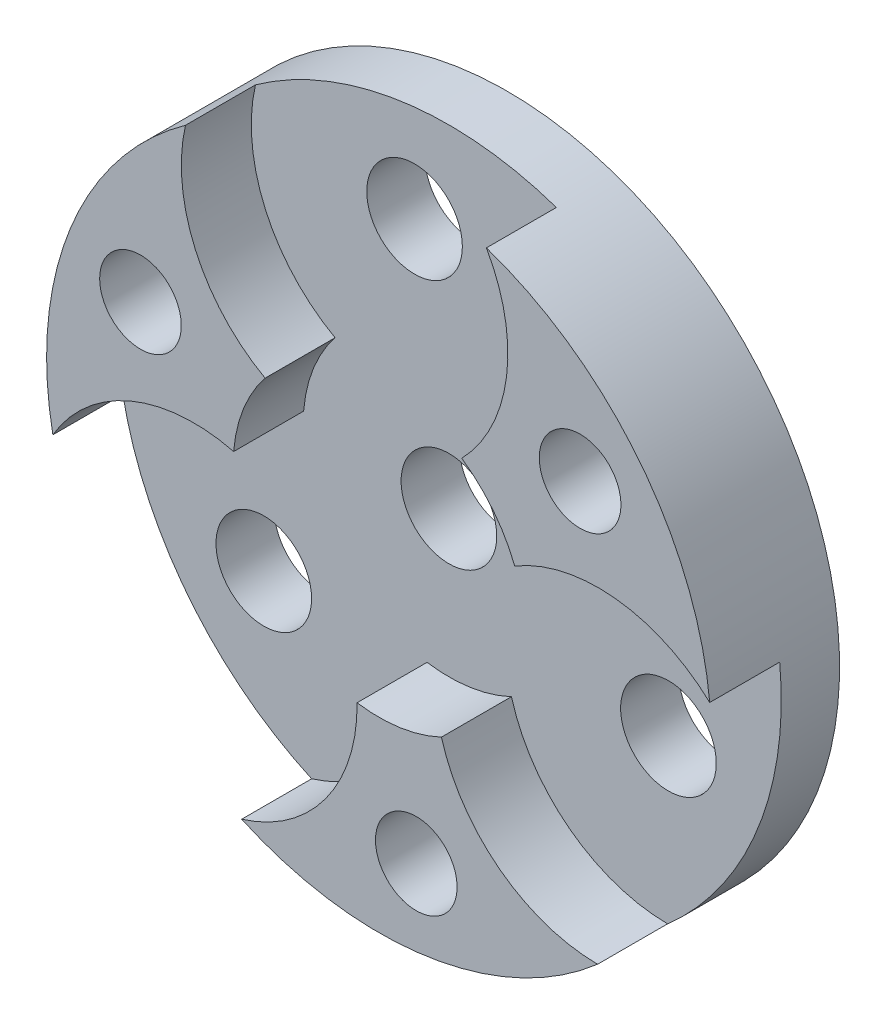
ISO-10303-21;
HEADER;
FILE_DESCRIPTION(('STEP AP214'),'2;1');
FILE_NAME('part.step','',(''),(''),'','','');
FILE_SCHEMA(('AUTOMOTIVE_DESIGN { 1 0 10303 214 1 1 1 1 }'));
ENDSEC;
DATA;
#1=APPLICATION_CONTEXT('core data for automotive mechanical design processes');
#2=APPLICATION_PROTOCOL_DEFINITION('international standard','automotive_design',2000,#1);
#3=PRODUCT_CONTEXT('',#1,'mechanical');
#4=PRODUCT('Part','Part','',(#3));
#5=PRODUCT_RELATED_PRODUCT_CATEGORY('part','',(#4));
#6=PRODUCT_DEFINITION_FORMATION('','',#4);
#7=PRODUCT_DEFINITION_CONTEXT('part definition',#1,'design');
#8=PRODUCT_DEFINITION('design','',#6,#7);
#9=PRODUCT_DEFINITION_SHAPE('','',#8);
#10=(LENGTH_UNIT() NAMED_UNIT(*) SI_UNIT(.MILLI.,.METRE.));
#11=(NAMED_UNIT(*) PLANE_ANGLE_UNIT() SI_UNIT($,.RADIAN.));
#12=(NAMED_UNIT(*) SI_UNIT($,.STERADIAN.) SOLID_ANGLE_UNIT());
#13=UNCERTAINTY_MEASURE_WITH_UNIT(LENGTH_MEASURE(1.E-05),#10,'distance_accuracy_value','');
#14=(GEOMETRIC_REPRESENTATION_CONTEXT(3) GLOBAL_UNCERTAINTY_ASSIGNED_CONTEXT((#13)) GLOBAL_UNIT_ASSIGNED_CONTEXT((#10,
#11,#12)) REPRESENTATION_CONTEXT('',''));
#15=CARTESIAN_POINT('',(0.,0.,0.));
#16=DIRECTION('',(0.,0.,1.));
#17=DIRECTION('',(1.,0.,0.));
#18=AXIS2_PLACEMENT_3D('',#15,#16,#17);
#19=CARTESIAN_POINT('',(-0.793834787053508,-0.628476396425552,3.65));
#20=DIRECTION('',(0.,0.,1.));
#21=DIRECTION('',(1.,0.,0.));
#22=AXIS2_PLACEMENT_3D('',#19,#20,#21);
#23=PLANE('',#22);
#24=CARTESIAN_POINT('',(-1.587669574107,-1.256952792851,3.65));
#25=DIRECTION('',(0.,0.,-1.));
#26=DIRECTION('',(1.,0.,0.));
#27=AXIS2_PLACEMENT_3D('',#24,#25,#26);
#28=CIRCLE('',#27,1.40000000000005);
#29=CARTESIAN_POINT('',(-0.187829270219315,-1.23580749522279,3.65));
#30=VERTEX_POINT('',#29);
#31=CARTESIAN_POINT('',(-1.17731552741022,-2.59546299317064,3.65));
#32=VERTEX_POINT('',#31);
#33=EDGE_CURVE('E134',#30,#32,#28,.T.);
#34=ORIENTED_EDGE('',*,*,#33,.T.);
#35=CARTESIAN_POINT('',(0.,-1.03649727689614E-13,3.65));
#36=DIRECTION('',(0.,0.,1.));
#37=DIRECTION('',(-1.,0.,0.));
#38=AXIS2_PLACEMENT_3D('',#35,#36,#37);
#39=CIRCLE('',#38,2.84999999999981);
#40=CARTESIAN_POINT('',(1.87488269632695,-2.14646567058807,3.65));
#41=VERTEX_POINT('',#40);
#42=EDGE_CURVE('E122',#32,#41,#39,.T.);
#43=ORIENTED_EDGE('',*,*,#42,.T.);
#44=CARTESIAN_POINT('',(1.88238783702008,-0.746485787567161,3.65));
#45=DIRECTION('',(0.,0.,-1.));
#46=DIRECTION('',(1.,0.,0.));
#47=AXIS2_PLACEMENT_3D('',#44,#45,#46);
#48=CIRCLE('',#47,1.40000000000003);
#49=CARTESIAN_POINT('',(0.535760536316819,-1.12936293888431,3.65));
#50=VERTEX_POINT('',#49);
#51=EDGE_CURVE('E133',#41,#50,#48,.T.);
#52=ORIENTED_EDGE('',*,*,#51,.T.);
#53=CARTESIAN_POINT('',(0.,-1.03649727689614E-13,3.65));
#54=DIRECTION('',(0.,0.,-1.));
#55=DIRECTION('',(1.,0.,0.));
#56=AXIS2_PLACEMENT_3D('',#53,#54,#55);
#57=CIRCLE('',#56,1.24999999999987);
#58=EDGE_CURVE('E139',#50,#30,#57,.T.);
#59=ORIENTED_EDGE('',*,*,#58,.T.);
#60=EDGE_LOOP('',(#34,#43,#52,#59));
#61=FACE_BOUND('',#60,.T.);
#62=CARTESIAN_POINT('',(0.320187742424,-2.176575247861,3.65));
#63=DIRECTION('',(0.,0.,-1.));
#64=DIRECTION('',(-1.,0.,0.));
#65=AXIS2_PLACEMENT_3D('',#62,#63,#64);
#66=CIRCLE('',#65,0.35);
#67=CARTESIAN_POINT('',(-0.0298122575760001,-2.176575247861,3.65));
#68=VERTEX_POINT('',#67);
#69=EDGE_CURVE('E345',#68,#68,#66,.T.);
#70=ORIENTED_EDGE('',*,*,#69,.T.);
#71=EDGE_LOOP('',(#70));
#72=FACE_BOUND('',#71,.T.);
#73=ADVANCED_FACE('F34',(#61,#72),#23,.T.);
#74=CARTESIAN_POINT('',(-0.147359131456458,1.0017192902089,3.05));
#75=DIRECTION('',(0.,0.,1.));
#76=DIRECTION('',(1.,0.,0.));
#77=AXIS2_PLACEMENT_3D('',#74,#75,#76);
#78=PLANE('',#77);
#79=CARTESIAN_POINT('',(-0.294718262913,2.003438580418,3.05));
#80=DIRECTION('',(0.,0.,1.));
#81=DIRECTION('',(1.,0.,0.));
#82=AXIS2_PLACEMENT_3D('',#79,#80,#81);
#83=CIRCLE('',#82,0.410000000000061);
#84=CARTESIAN_POINT('',(0.115281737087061,2.003438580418,3.05));
#85=VERTEX_POINT('',#84);
#86=EDGE_CURVE('E342',#85,#85,#83,.T.);
#87=ORIENTED_EDGE('',*,*,#86,.F.);
#88=EDGE_LOOP('',(#87));
#89=FACE_BOUND('',#88,.T.);
#90=CARTESIAN_POINT('',(-1.587669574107,-1.256952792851,3.05));
#91=DIRECTION('',(0.,0.,1.));
#92=DIRECTION('',(1.,0.,0.));
#93=AXIS2_PLACEMENT_3D('',#90,#91,#92);
#94=CIRCLE('',#93,0.410000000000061);
#95=CARTESIAN_POINT('',(-1.17766957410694,-1.256952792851,3.05));
#96=VERTEX_POINT('',#95);
#97=EDGE_CURVE('E338',#96,#96,#94,.T.);
#98=ORIENTED_EDGE('',*,*,#97,.F.);
#99=EDGE_LOOP('',(#98));
#100=FACE_BOUND('',#99,.T.);
#101=CARTESIAN_POINT('',(1.88238783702,-0.7464857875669,3.05));
#102=DIRECTION('',(0.,0.,1.));
#103=DIRECTION('',(1.,0.,0.));
#104=AXIS2_PLACEMENT_3D('',#101,#102,#103);
#105=CIRCLE('',#104,0.410000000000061);
#106=CARTESIAN_POINT('',(2.29238783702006,-0.7464857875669,3.05));
#107=VERTEX_POINT('',#106);
#108=EDGE_CURVE('E334',#107,#107,#105,.T.);
#109=ORIENTED_EDGE('',*,*,#108,.F.);
#110=EDGE_LOOP('',(#109));
#111=FACE_BOUND('',#110,.T.);
#112=CARTESIAN_POINT('',(0.,0.,3.05));
#113=DIRECTION('',(0.,0.,1.));
#114=DIRECTION('',(1.,0.,0.));
#115=AXIS2_PLACEMENT_3D('',#112,#113,#114);
#116=CIRCLE('',#115,0.410000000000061);
#117=CARTESIAN_POINT('',(0.410000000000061,0.,3.05));
#118=VERTEX_POINT('',#117);
#119=EDGE_CURVE('E297',#118,#118,#116,.T.);
#120=ORIENTED_EDGE('',*,*,#119,.F.);
#121=EDGE_LOOP('',(#120));
#122=FACE_BOUND('',#121,.T.);
#123=CARTESIAN_POINT('',(0.,0.,3.05));
#124=DIRECTION('',(0.,0.,1.));
#125=DIRECTION('',(1.,0.,0.));
#126=AXIS2_PLACEMENT_3D('',#123,#124,#125);
#127=CIRCLE('',#126,2.84999999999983);
#128=CARTESIAN_POINT('',(-2.79633514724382,-0.550463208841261,3.05));
#129=VERTEX_POINT('',#128);
#130=CARTESIAN_POINT('',(-1.17731552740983,-2.5954629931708,3.05));
#131=VERTEX_POINT('',#130);
#132=EDGE_CURVE('E178',#129,#131,#127,.T.);
#133=ORIENTED_EDGE('',*,*,#132,.T.);
#134=CARTESIAN_POINT('',(-1.587669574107,-1.256952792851,3.05));
#135=DIRECTION('',(0.,0.,-1.));
#136=DIRECTION('',(1.,0.,0.));
#137=AXIS2_PLACEMENT_3D('',#134,#135,#136);
#138=CIRCLE('',#137,1.40000000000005);
#139=CARTESIAN_POINT('',(-0.187829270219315,-1.23580749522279,3.05));
#140=VERTEX_POINT('',#139);
#141=EDGE_CURVE('E54',#140,#131,#138,.T.);
#142=ORIENTED_EDGE('',*,*,#141,.F.);
#143=CARTESIAN_POINT('',(0.,-1.03649727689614E-13,3.05));
#144=DIRECTION('',(0.,0.,-1.));
#145=DIRECTION('',(1.,0.,0.));
#146=AXIS2_PLACEMENT_3D('',#143,#144,#145);
#147=CIRCLE('',#146,1.24999999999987);
#148=CARTESIAN_POINT('',(0.535760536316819,-1.12936293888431,3.05));
#149=VERTEX_POINT('',#148);
#150=EDGE_CURVE('E49',#149,#140,#147,.T.);
#151=ORIENTED_EDGE('',*,*,#150,.F.);
#152=CARTESIAN_POINT('',(1.88238783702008,-0.746485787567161,3.05));
#153=DIRECTION('',(0.,0.,-1.));
#154=DIRECTION('',(1.,0.,0.));
#155=AXIS2_PLACEMENT_3D('',#152,#153,#154);
#156=CIRCLE('',#155,1.40000000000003);
#157=CARTESIAN_POINT('',(1.87488269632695,-2.14646567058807,3.05));
#158=VERTEX_POINT('',#157);
#159=EDGE_CURVE('E299',#158,#149,#156,.T.);
#160=ORIENTED_EDGE('',*,*,#159,.F.);
#161=CARTESIAN_POINT('',(2.83639465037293,0.278146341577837,3.05));
#162=VERTEX_POINT('',#161);
#163=EDGE_CURVE('E181',#158,#162,#127,.T.);
#164=ORIENTED_EDGE('',*,*,#163,.T.);
#165=CARTESIAN_POINT('',(1.88238783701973,-0.746485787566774,3.05));
#166=DIRECTION('',(0.,0.,-1.));
#167=DIRECTION('',(1.,0.,0.));
#168=AXIS2_PLACEMENT_3D('',#165,#166,#167);
#169=CIRCLE('',#168,1.39999999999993);
#170=CARTESIAN_POINT('',(1.16415532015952,0.455238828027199,3.05));
#171=VERTEX_POINT('',#170);
#172=EDGE_CURVE('E145',#171,#162,#169,.T.);
#173=ORIENTED_EDGE('',*,*,#172,.F.);
#174=CARTESIAN_POINT('',(-1.7206288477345E-13,0.,3.05));
#175=DIRECTION('',(0.,0.,-1.));
#176=DIRECTION('',(1.,0.,0.));
#177=AXIS2_PLACEMENT_3D('',#174,#175,#176);
#178=CIRCLE('',#177,1.24999999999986);
#179=CARTESIAN_POINT('',(0.710176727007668,1.02866370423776,3.05));
#180=VERTEX_POINT('',#179);
#181=EDGE_CURVE('E158',#180,#171,#178,.T.);
#182=ORIENTED_EDGE('',*,*,#181,.F.);
#183=CARTESIAN_POINT('',(-0.294718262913,2.003438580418,3.05));
#184=DIRECTION('',(0.,0.,-1.));
#185=DIRECTION('',(1.,0.,0.));
#186=AXIS2_PLACEMENT_3D('',#183,#184,#185);
#187=CIRCLE('',#186,1.39999999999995);
#188=CARTESIAN_POINT('',(0.921452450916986,2.69692887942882,3.05));
#189=VERTEX_POINT('',#188);
#190=EDGE_CURVE('E148',#189,#180,#187,.T.);
#191=ORIENTED_EDGE('',*,*,#190,.F.);
#192=CARTESIAN_POINT('',(-1.65907912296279,2.31731665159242,3.05));
#193=VERTEX_POINT('',#192);
#194=EDGE_CURVE('E182',#189,#193,#127,.T.);
#195=ORIENTED_EDGE('',*,*,#194,.T.);
#196=CARTESIAN_POINT('',(-0.294718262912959,2.0034385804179,3.05));
#197=DIRECTION('',(0.,0.,1.));
#198=DIRECTION('',(1.,0.,0.));
#199=AXIS2_PLACEMENT_3D('',#196,#197,#198);
#200=CIRCLE('',#199,1.40000000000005);
#201=CARTESIAN_POINT('',(-0.976326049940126,0.780568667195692,3.05));
#202=VERTEX_POINT('',#201);
#203=EDGE_CURVE('E180',#193,#202,#200,.T.);
#204=ORIENTED_EDGE('',*,*,#203,.T.);
#205=CARTESIAN_POINT('',(0.,0.,3.05));
#206=DIRECTION('',(0.,0.,1.));
#207=DIRECTION('',(1.,0.,0.));
#208=AXIS2_PLACEMENT_3D('',#205,#206,#207);
#209=CIRCLE('',#208,1.24999999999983);
#210=CARTESIAN_POINT('',(-1.24593726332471,0.100699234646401,3.05));
#211=VERTEX_POINT('',#210);
#212=EDGE_CURVE('E185',#202,#211,#209,.T.);
#213=ORIENTED_EDGE('',*,*,#212,.T.);
#214=CARTESIAN_POINT('',(-1.587669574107,-1.256952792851,3.05));
#215=DIRECTION('',(0.,0.,1.));
#216=DIRECTION('',(1.,0.,0.));
#217=AXIS2_PLACEMENT_3D('',#214,#215,#216);
#218=CIRCLE('',#217,1.40000000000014);
#219=EDGE_CURVE('E188',#211,#129,#218,.T.);
#220=ORIENTED_EDGE('',*,*,#219,.T.);
#221=EDGE_LOOP('',(#133,#142,#151,#160,#164,#173,#182,#191,#195,#204,#213,#220));
#222=FACE_BOUND('',#221,.T.);
#223=ADVANCED_FACE('F211',(#89,#100,#111,#122,#222),#78,.T.);
#224=CARTESIAN_POINT('',(0.,0.,3.65));
#225=DIRECTION('',(0.,0.,-1.));
#226=DIRECTION('',(-1.,0.,0.));
#227=AXIS2_PLACEMENT_3D('',#224,#225,#226);
#228=CYLINDRICAL_SURFACE('',#227,2.84999999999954);
#229=DIRECTION('',(0.,0.,1.));
#230=VECTOR('',#229,1.);
#231=CARTESIAN_POINT('',(-2.79633514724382,-0.550463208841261,3.05));
#232=LINE('',#231,#230);
#233=CARTESIAN_POINT('',(-2.79633514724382,-0.550463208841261,3.65));
#234=VERTEX_POINT('',#233);
#235=EDGE_CURVE('E199',#129,#234,#232,.T.);
#236=ORIENTED_EDGE('',*,*,#235,.T.);
#237=CARTESIAN_POINT('',(0.,0.,3.65));
#238=DIRECTION('',(0.,0.,-1.));
#239=DIRECTION('',(-1.,0.,0.));
#240=AXIS2_PLACEMENT_3D('',#237,#238,#239);
#241=CIRCLE('',#240,2.84999999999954);
#242=CARTESIAN_POINT('',(-1.65907912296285,2.31731665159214,3.65));
#243=VERTEX_POINT('',#242);
#244=EDGE_CURVE('E11',#234,#243,#241,.T.);
#245=ORIENTED_EDGE('',*,*,#244,.T.);
#246=DIRECTION('',(0.,0.,1.));
#247=VECTOR('',#246,1.);
#248=CARTESIAN_POINT('',(-1.65907912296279,2.31731665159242,3.05));
#249=LINE('',#248,#247);
#250=EDGE_CURVE('E191',#193,#243,#249,.T.);
#251=ORIENTED_EDGE('',*,*,#250,.F.);
#252=ORIENTED_EDGE('',*,*,#194,.F.);
#253=DIRECTION('',(0.,0.,-1.));
#254=VECTOR('',#253,1.);
#255=CARTESIAN_POINT('',(0.921452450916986,2.69692887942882,3.65));
#256=LINE('',#255,#254);
#257=CARTESIAN_POINT('',(0.921452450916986,2.69692887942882,3.65));
#258=VERTEX_POINT('',#257);
#259=EDGE_CURVE('E172',#258,#189,#256,.T.);
#260=ORIENTED_EDGE('',*,*,#259,.F.);
#261=CARTESIAN_POINT('',(-1.7206288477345E-13,0.,3.65));
#262=DIRECTION('',(0.,0.,1.));
#263=DIRECTION('',(-1.,0.,0.));
#264=AXIS2_PLACEMENT_3D('',#261,#262,#263);
#265=CIRCLE('',#264,2.8499999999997);
#266=CARTESIAN_POINT('',(2.83639465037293,0.278146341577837,3.65));
#267=VERTEX_POINT('',#266);
#268=EDGE_CURVE('E157',#267,#258,#265,.T.);
#269=ORIENTED_EDGE('',*,*,#268,.F.);
#270=DIRECTION('',(0.,0.,-1.));
#271=VECTOR('',#270,1.);
#272=CARTESIAN_POINT('',(2.83639465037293,0.278146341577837,3.65));
#273=LINE('',#272,#271);
#274=EDGE_CURVE('E174',#267,#162,#273,.T.);
#275=ORIENTED_EDGE('',*,*,#274,.T.);
#276=ORIENTED_EDGE('',*,*,#163,.F.);
#277=DIRECTION('',(0.,0.,-1.));
#278=VECTOR('',#277,1.);
#279=CARTESIAN_POINT('',(1.87488269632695,-2.14646567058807,3.65));
#280=LINE('',#279,#278);
#281=EDGE_CURVE('E130',#41,#158,#280,.T.);
#282=ORIENTED_EDGE('',*,*,#281,.F.);
#283=ORIENTED_EDGE('',*,*,#42,.F.);
#284=DIRECTION('',(0.,0.,-1.));
#285=VECTOR('',#284,1.);
#286=CARTESIAN_POINT('',(-1.17731552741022,-2.59546299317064,3.65));
#287=LINE('',#286,#285);
#288=EDGE_CURVE('E128',#32,#131,#287,.T.);
#289=ORIENTED_EDGE('',*,*,#288,.T.);
#290=ORIENTED_EDGE('',*,*,#132,.F.);
#291=EDGE_LOOP('',(#236,#245,#251,#252,#260,#269,#275,#276,#282,#283,#289,#290));
#292=FACE_BOUND('',#291,.T.);
#293=CARTESIAN_POINT('',(0.,0.,2.55));
#294=DIRECTION('',(0.,0.,-1.));
#295=DIRECTION('',(-1.,0.,0.));
#296=AXIS2_PLACEMENT_3D('',#293,#294,#295);
#297=CIRCLE('',#296,2.84999999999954);
#298=CARTESIAN_POINT('',(-2.84999999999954,0.,2.55));
#299=VERTEX_POINT('',#298);
#300=EDGE_CURVE('E42',#299,#299,#297,.T.);
#301=ORIENTED_EDGE('',*,*,#300,.F.);
#302=EDGE_LOOP('',(#301));
#303=FACE_BOUND('',#302,.T.);
#304=ADVANCED_FACE('F36',(#292,#303),#228,.T.);
#305=CARTESIAN_POINT('',(2.84999999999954,0.,3.65));
#306=DIRECTION('',(0.,0.,1.));
#307=DIRECTION('',(1.,0.,0.));
#308=AXIS2_PLACEMENT_3D('',#305,#306,#307);
#309=PLANE('',#308);
#310=CARTESIAN_POINT('',(-2.045063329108,0.810996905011,3.65));
#311=DIRECTION('',(0.,0.,-1.));
#312=DIRECTION('',(-1.,0.,0.));
#313=AXIS2_PLACEMENT_3D('',#310,#311,#312);
#314=CIRCLE('',#313,0.35);
#315=CARTESIAN_POINT('',(-2.395063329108,0.810996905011,3.65));
#316=VERTEX_POINT('',#315);
#317=EDGE_CURVE('E349',#316,#316,#314,.T.);
#318=ORIENTED_EDGE('',*,*,#317,.T.);
#319=EDGE_LOOP('',(#318));
#320=FACE_BOUND('',#319,.T.);
#321=CARTESIAN_POINT('',(-1.587669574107,-1.256952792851,3.65));
#322=DIRECTION('',(0.,0.,1.));
#323=DIRECTION('',(1.,0.,0.));
#324=AXIS2_PLACEMENT_3D('',#321,#322,#323);
#325=CIRCLE('',#324,1.40000000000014);
#326=CARTESIAN_POINT('',(-1.24593726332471,0.100699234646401,3.65));
#327=VERTEX_POINT('',#326);
#328=EDGE_CURVE('E197',#327,#234,#325,.T.);
#329=ORIENTED_EDGE('',*,*,#328,.F.);
#330=CARTESIAN_POINT('',(0.,0.,3.65));
#331=DIRECTION('',(0.,0.,1.));
#332=DIRECTION('',(1.,0.,0.));
#333=AXIS2_PLACEMENT_3D('',#330,#331,#332);
#334=CIRCLE('',#333,1.24999999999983);
#335=CARTESIAN_POINT('',(-0.976326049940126,0.780568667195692,3.65));
#336=VERTEX_POINT('',#335);
#337=EDGE_CURVE('E194',#336,#327,#334,.T.);
#338=ORIENTED_EDGE('',*,*,#337,.F.);
#339=CARTESIAN_POINT('',(-0.294718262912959,2.0034385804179,3.65));
#340=DIRECTION('',(0.,0.,1.));
#341=DIRECTION('',(1.,0.,0.));
#342=AXIS2_PLACEMENT_3D('',#339,#340,#341);
#343=CIRCLE('',#342,1.40000000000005);
#344=EDGE_CURVE('E177',#243,#336,#343,.T.);
#345=ORIENTED_EDGE('',*,*,#344,.F.);
#346=ORIENTED_EDGE('',*,*,#244,.F.);
#347=EDGE_LOOP('',(#329,#338,#345,#346));
#348=FACE_BOUND('',#347,.T.);
#349=ADVANCED_FACE('F210',(#320,#348),#309,.T.);
#350=CARTESIAN_POINT('',(0.,0.,2.55));
#351=DIRECTION('',(0.,0.,-1.));
#352=DIRECTION('',(-1.,0.,0.));
#353=AXIS2_PLACEMENT_3D('',#350,#351,#352);
#354=PLANE('',#353);
#355=CARTESIAN_POINT('',(1.724875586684,1.36557834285,2.55));
#356=DIRECTION('',(0.,0.,-1.));
#357=DIRECTION('',(-1.,0.,0.));
#358=AXIS2_PLACEMENT_3D('',#355,#356,#357);
#359=CIRCLE('',#358,0.35);
#360=CARTESIAN_POINT('',(1.374875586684,1.36557834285,2.55));
#361=VERTEX_POINT('',#360);
#362=EDGE_CURVE('E272',#361,#361,#359,.T.);
#363=ORIENTED_EDGE('',*,*,#362,.F.);
#364=EDGE_LOOP('',(#363));
#365=FACE_BOUND('',#364,.T.);
#366=CARTESIAN_POINT('',(-2.045063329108,0.810996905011,2.55));
#367=DIRECTION('',(0.,0.,-1.));
#368=DIRECTION('',(-1.,0.,0.));
#369=AXIS2_PLACEMENT_3D('',#366,#367,#368);
#370=CIRCLE('',#369,0.35);
#371=CARTESIAN_POINT('',(-2.395063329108,0.810996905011,2.55));
#372=VERTEX_POINT('',#371);
#373=EDGE_CURVE('E276',#372,#372,#370,.T.);
#374=ORIENTED_EDGE('',*,*,#373,.F.);
#375=EDGE_LOOP('',(#374));
#376=FACE_BOUND('',#375,.T.);
#377=CARTESIAN_POINT('',(0.320187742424,-2.176575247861,2.55));
#378=DIRECTION('',(0.,0.,-1.));
#379=DIRECTION('',(-1.,0.,0.));
#380=AXIS2_PLACEMENT_3D('',#377,#378,#379);
#381=CIRCLE('',#380,0.35);
#382=CARTESIAN_POINT('',(-0.0298122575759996,-2.176575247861,2.55));
#383=VERTEX_POINT('',#382);
#384=EDGE_CURVE('E280',#383,#383,#381,.T.);
#385=ORIENTED_EDGE('',*,*,#384,.F.);
#386=EDGE_LOOP('',(#385));
#387=FACE_BOUND('',#386,.T.);
#388=CARTESIAN_POINT('',(-0.294718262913,2.003438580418,2.55));
#389=DIRECTION('',(0.,0.,1.));
#390=DIRECTION('',(1.,0.,0.));
#391=AXIS2_PLACEMENT_3D('',#388,#389,#390);
#392=CIRCLE('',#391,0.410000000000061);
#393=CARTESIAN_POINT('',(0.115281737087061,2.003438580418,2.55));
#394=VERTEX_POINT('',#393);
#395=EDGE_CURVE('E284',#394,#394,#392,.T.);
#396=ORIENTED_EDGE('',*,*,#395,.T.);
#397=EDGE_LOOP('',(#396));
#398=FACE_BOUND('',#397,.T.);
#399=CARTESIAN_POINT('',(-1.587669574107,-1.256952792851,2.55));
#400=DIRECTION('',(0.,0.,1.));
#401=DIRECTION('',(1.,0.,0.));
#402=AXIS2_PLACEMENT_3D('',#399,#400,#401);
#403=CIRCLE('',#402,0.410000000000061);
#404=CARTESIAN_POINT('',(-1.17766957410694,-1.256952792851,2.55));
#405=VERTEX_POINT('',#404);
#406=EDGE_CURVE('E288',#405,#405,#403,.T.);
#407=ORIENTED_EDGE('',*,*,#406,.T.);
#408=EDGE_LOOP('',(#407));
#409=FACE_BOUND('',#408,.T.);
#410=CARTESIAN_POINT('',(1.88238783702,-0.7464857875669,2.55));
#411=DIRECTION('',(0.,0.,1.));
#412=DIRECTION('',(1.,0.,0.));
#413=AXIS2_PLACEMENT_3D('',#410,#411,#412);
#414=CIRCLE('',#413,0.410000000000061);
#415=CARTESIAN_POINT('',(2.29238783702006,-0.7464857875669,2.55));
#416=VERTEX_POINT('',#415);
#417=EDGE_CURVE('E292',#416,#416,#414,.T.);
#418=ORIENTED_EDGE('',*,*,#417,.T.);
#419=EDGE_LOOP('',(#418));
#420=FACE_BOUND('',#419,.T.);
#421=CARTESIAN_POINT('',(0.,0.,2.55));
#422=DIRECTION('',(0.,0.,1.));
#423=DIRECTION('',(1.,0.,0.));
#424=AXIS2_PLACEMENT_3D('',#421,#422,#423);
#425=CIRCLE('',#424,0.410000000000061);
#426=CARTESIAN_POINT('',(0.410000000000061,0.,2.55));
#427=VERTEX_POINT('',#426);
#428=EDGE_CURVE('E295',#427,#427,#425,.T.);
#429=ORIENTED_EDGE('',*,*,#428,.T.);
#430=EDGE_LOOP('',(#429));
#431=FACE_BOUND('',#430,.T.);
#432=ORIENTED_EDGE('',*,*,#300,.T.);
#433=EDGE_LOOP('',(#432));
#434=FACE_BOUND('',#433,.T.);
#435=ADVANCED_FACE('F208',(#365,#376,#387,#398,#409,#420,#431,#434),#354,.T.);
#436=CARTESIAN_POINT('',(-1.587669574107,-1.256952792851,3.05));
#437=DIRECTION('',(0.,0.,1.));
#438=DIRECTION('',(1.,0.,0.));
#439=AXIS2_PLACEMENT_3D('',#436,#437,#438);
#440=CYLINDRICAL_SURFACE('',#439,1.40000000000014);
#441=ORIENTED_EDGE('',*,*,#328,.T.);
#442=ORIENTED_EDGE('',*,*,#235,.F.);
#443=ORIENTED_EDGE('',*,*,#219,.F.);
#444=DIRECTION('',(0.,0.,1.));
#445=VECTOR('',#444,1.);
#446=CARTESIAN_POINT('',(-1.24593726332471,0.100699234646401,3.05));
#447=LINE('',#446,#445);
#448=EDGE_CURVE('E201',#211,#327,#447,.T.);
#449=ORIENTED_EDGE('',*,*,#448,.T.);
#450=EDGE_LOOP('',(#441,#442,#443,#449));
#451=FACE_BOUND('',#450,.T.);
#452=ADVANCED_FACE('F254',(#451),#440,.F.);
#453=CARTESIAN_POINT('',(0.,0.,3.05));
#454=DIRECTION('',(0.,0.,1.));
#455=DIRECTION('',(1.,0.,0.));
#456=AXIS2_PLACEMENT_3D('',#453,#454,#455);
#457=CYLINDRICAL_SURFACE('',#456,1.24999999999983);
#458=ORIENTED_EDGE('',*,*,#337,.T.);
#459=ORIENTED_EDGE('',*,*,#448,.F.);
#460=ORIENTED_EDGE('',*,*,#212,.F.);
#461=DIRECTION('',(0.,0.,1.));
#462=VECTOR('',#461,1.);
#463=CARTESIAN_POINT('',(-0.976326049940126,0.780568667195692,3.05));
#464=LINE('',#463,#462);
#465=EDGE_CURVE('E203',#202,#336,#464,.T.);
#466=ORIENTED_EDGE('',*,*,#465,.T.);
#467=EDGE_LOOP('',(#458,#459,#460,#466));
#468=FACE_BOUND('',#467,.T.);
#469=ADVANCED_FACE('F257',(#468),#457,.F.);
#470=CARTESIAN_POINT('',(-0.294718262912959,2.0034385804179,3.05));
#471=DIRECTION('',(0.,0.,1.));
#472=DIRECTION('',(1.,0.,0.));
#473=AXIS2_PLACEMENT_3D('',#470,#471,#472);
#474=CYLINDRICAL_SURFACE('',#473,1.40000000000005);
#475=ORIENTED_EDGE('',*,*,#344,.T.);
#476=ORIENTED_EDGE('',*,*,#465,.F.);
#477=ORIENTED_EDGE('',*,*,#203,.F.);
#478=ORIENTED_EDGE('',*,*,#250,.T.);
#479=EDGE_LOOP('',(#475,#476,#477,#478));
#480=FACE_BOUND('',#479,.T.);
#481=ADVANCED_FACE('F251',(#480),#474,.F.);
#482=CARTESIAN_POINT('',(1.88238783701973,-0.746485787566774,3.65));
#483=DIRECTION('',(0.,0.,-1.));
#484=DIRECTION('',(-1.,0.,0.));
#485=AXIS2_PLACEMENT_3D('',#482,#483,#484);
#486=CYLINDRICAL_SURFACE('',#485,1.39999999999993);
#487=ORIENTED_EDGE('',*,*,#172,.T.);
#488=ORIENTED_EDGE('',*,*,#274,.F.);
#489=CARTESIAN_POINT('',(1.88238783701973,-0.746485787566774,3.65));
#490=DIRECTION('',(0.,0.,-1.));
#491=DIRECTION('',(1.,0.,0.));
#492=AXIS2_PLACEMENT_3D('',#489,#490,#491);
#493=CIRCLE('',#492,1.39999999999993);
#494=CARTESIAN_POINT('',(1.16415532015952,0.455238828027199,3.65));
#495=VERTEX_POINT('',#494);
#496=EDGE_CURVE('E154',#495,#267,#493,.T.);
#497=ORIENTED_EDGE('',*,*,#496,.F.);
#498=DIRECTION('',(0.,0.,-1.));
#499=VECTOR('',#498,1.);
#500=CARTESIAN_POINT('',(1.16415532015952,0.455238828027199,3.65));
#501=LINE('',#500,#499);
#502=EDGE_CURVE('E163',#495,#171,#501,.T.);
#503=ORIENTED_EDGE('',*,*,#502,.T.);
#504=EDGE_LOOP('',(#487,#488,#497,#503));
#505=FACE_BOUND('',#504,.T.);
#506=ADVANCED_FACE('F248',(#505),#486,.F.);
#507=CARTESIAN_POINT('',(-0.294718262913,2.003438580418,3.65));
#508=DIRECTION('',(0.,0.,-1.));
#509=DIRECTION('',(-1.,0.,0.));
#510=AXIS2_PLACEMENT_3D('',#507,#508,#509);
#511=CYLINDRICAL_SURFACE('',#510,1.39999999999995);
#512=ORIENTED_EDGE('',*,*,#190,.T.);
#513=DIRECTION('',(0.,0.,-1.));
#514=VECTOR('',#513,1.);
#515=CARTESIAN_POINT('',(0.710176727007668,1.02866370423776,3.65));
#516=LINE('',#515,#514);
#517=CARTESIAN_POINT('',(0.710176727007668,1.02866370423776,3.65));
#518=VERTEX_POINT('',#517);
#519=EDGE_CURVE('E170',#518,#180,#516,.T.);
#520=ORIENTED_EDGE('',*,*,#519,.F.);
#521=CARTESIAN_POINT('',(-0.294718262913,2.003438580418,3.65));
#522=DIRECTION('',(0.,0.,-1.));
#523=DIRECTION('',(1.,0.,0.));
#524=AXIS2_PLACEMENT_3D('',#521,#522,#523);
#525=CIRCLE('',#524,1.39999999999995);
#526=EDGE_CURVE('E160',#258,#518,#525,.T.);
#527=ORIENTED_EDGE('',*,*,#526,.F.);
#528=ORIENTED_EDGE('',*,*,#259,.T.);
#529=EDGE_LOOP('',(#512,#520,#527,#528));
#530=FACE_BOUND('',#529,.T.);
#531=ADVANCED_FACE('F244',(#530),#511,.F.);
#532=CARTESIAN_POINT('',(-1.7206288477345E-13,0.,3.65));
#533=DIRECTION('',(0.,0.,-1.));
#534=DIRECTION('',(-1.,0.,0.));
#535=AXIS2_PLACEMENT_3D('',#532,#533,#534);
#536=CYLINDRICAL_SURFACE('',#535,1.24999999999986);
#537=ORIENTED_EDGE('',*,*,#181,.T.);
#538=ORIENTED_EDGE('',*,*,#502,.F.);
#539=CARTESIAN_POINT('',(-1.7206288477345E-13,0.,3.65));
#540=DIRECTION('',(0.,0.,-1.));
#541=DIRECTION('',(1.,0.,0.));
#542=AXIS2_PLACEMENT_3D('',#539,#540,#541);
#543=CIRCLE('',#542,1.24999999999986);
#544=EDGE_CURVE('E162',#518,#495,#543,.T.);
#545=ORIENTED_EDGE('',*,*,#544,.F.);
#546=ORIENTED_EDGE('',*,*,#519,.T.);
#547=EDGE_LOOP('',(#537,#538,#545,#546));
#548=FACE_BOUND('',#547,.T.);
#549=ADVANCED_FACE('F240',(#548),#536,.F.);
#550=CARTESIAN_POINT('',(0.941193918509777,-0.373242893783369,3.65));
#551=DIRECTION('',(0.,0.,1.));
#552=DIRECTION('',(1.,0.,0.));
#553=AXIS2_PLACEMENT_3D('',#550,#551,#552);
#554=PLANE('',#553);
#555=CARTESIAN_POINT('',(1.724875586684,1.36557834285,3.65));
#556=DIRECTION('',(0.,0.,-1.));
#557=DIRECTION('',(-1.,0.,0.));
#558=AXIS2_PLACEMENT_3D('',#555,#556,#557);
#559=CIRCLE('',#558,0.35);
#560=CARTESIAN_POINT('',(1.374875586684,1.36557834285,3.65));
#561=VERTEX_POINT('',#560);
#562=EDGE_CURVE('E353',#561,#561,#559,.T.);
#563=ORIENTED_EDGE('',*,*,#562,.T.);
#564=EDGE_LOOP('',(#563));
#565=FACE_BOUND('',#564,.T.);
#566=ORIENTED_EDGE('',*,*,#496,.T.);
#567=ORIENTED_EDGE('',*,*,#268,.T.);
#568=ORIENTED_EDGE('',*,*,#526,.T.);
#569=ORIENTED_EDGE('',*,*,#544,.T.);
#570=EDGE_LOOP('',(#566,#567,#568,#569));
#571=FACE_BOUND('',#570,.T.);
#572=ADVANCED_FACE('F237',(#565,#571),#554,.T.);
#573=CARTESIAN_POINT('',(-1.587669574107,-1.256952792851,3.65));
#574=DIRECTION('',(0.,0.,-1.));
#575=DIRECTION('',(-1.,0.,0.));
#576=AXIS2_PLACEMENT_3D('',#573,#574,#575);
#577=CYLINDRICAL_SURFACE('',#576,1.40000000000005);
#578=ORIENTED_EDGE('',*,*,#141,.T.);
#579=ORIENTED_EDGE('',*,*,#288,.F.);
#580=ORIENTED_EDGE('',*,*,#33,.F.);
#581=DIRECTION('',(0.,0.,-1.));
#582=VECTOR('',#581,1.);
#583=CARTESIAN_POINT('',(-0.187829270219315,-1.23580749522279,3.65));
#584=LINE('',#583,#582);
#585=EDGE_CURVE('E306',#30,#140,#584,.T.);
#586=ORIENTED_EDGE('',*,*,#585,.T.);
#587=EDGE_LOOP('',(#578,#579,#580,#586));
#588=FACE_BOUND('',#587,.T.);
#589=ADVANCED_FACE('F144',(#588),#577,.F.);
#590=CARTESIAN_POINT('',(1.88238783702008,-0.746485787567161,3.65));
#591=DIRECTION('',(0.,0.,-1.));
#592=DIRECTION('',(-1.,0.,0.));
#593=AXIS2_PLACEMENT_3D('',#590,#591,#592);
#594=CYLINDRICAL_SURFACE('',#593,1.40000000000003);
#595=ORIENTED_EDGE('',*,*,#159,.T.);
#596=DIRECTION('',(0.,0.,-1.));
#597=VECTOR('',#596,1.);
#598=CARTESIAN_POINT('',(0.535760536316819,-1.12936293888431,3.65));
#599=LINE('',#598,#597);
#600=EDGE_CURVE('E150',#50,#149,#599,.T.);
#601=ORIENTED_EDGE('',*,*,#600,.F.);
#602=ORIENTED_EDGE('',*,*,#51,.F.);
#603=ORIENTED_EDGE('',*,*,#281,.T.);
#604=EDGE_LOOP('',(#595,#601,#602,#603));
#605=FACE_BOUND('',#604,.T.);
#606=ADVANCED_FACE('F230',(#605),#594,.F.);
#607=CARTESIAN_POINT('',(0.,-1.03649727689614E-13,3.65));
#608=DIRECTION('',(0.,0.,-1.));
#609=DIRECTION('',(-1.,0.,0.));
#610=AXIS2_PLACEMENT_3D('',#607,#608,#609);
#611=CYLINDRICAL_SURFACE('',#610,1.24999999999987);
#612=ORIENTED_EDGE('',*,*,#150,.T.);
#613=ORIENTED_EDGE('',*,*,#585,.F.);
#614=ORIENTED_EDGE('',*,*,#58,.F.);
#615=ORIENTED_EDGE('',*,*,#600,.T.);
#616=EDGE_LOOP('',(#612,#613,#614,#615));
#617=FACE_BOUND('',#616,.T.);
#618=ADVANCED_FACE('F227',(#617),#611,.F.);
#619=CARTESIAN_POINT('',(0.,0.,3.05));
#620=DIRECTION('',(0.,0.,1.));
#621=DIRECTION('',(1.,0.,0.));
#622=AXIS2_PLACEMENT_3D('',#619,#620,#621);
#623=CYLINDRICAL_SURFACE('',#622,0.410000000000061);
#624=ORIENTED_EDGE('',*,*,#428,.F.);
#625=EDGE_LOOP('',(#624));
#626=FACE_BOUND('',#625,.T.);
#627=ORIENTED_EDGE('',*,*,#119,.T.);
#628=EDGE_LOOP('',(#627));
#629=FACE_BOUND('',#628,.T.);
#630=ADVANCED_FACE('F225',(#626,#629),#623,.F.);
#631=CARTESIAN_POINT('',(1.88238783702,-0.7464857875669,3.05));
#632=DIRECTION('',(0.,0.,1.));
#633=DIRECTION('',(1.,0.,0.));
#634=AXIS2_PLACEMENT_3D('',#631,#632,#633);
#635=CYLINDRICAL_SURFACE('',#634,0.410000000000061);
#636=ORIENTED_EDGE('',*,*,#417,.F.);
#637=EDGE_LOOP('',(#636));
#638=FACE_BOUND('',#637,.T.);
#639=ORIENTED_EDGE('',*,*,#108,.T.);
#640=EDGE_LOOP('',(#639));
#641=FACE_BOUND('',#640,.T.);
#642=ADVANCED_FACE('F379',(#638,#641),#635,.F.);
#643=CARTESIAN_POINT('',(-1.587669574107,-1.256952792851,3.05));
#644=DIRECTION('',(0.,0.,1.));
#645=DIRECTION('',(1.,0.,0.));
#646=AXIS2_PLACEMENT_3D('',#643,#644,#645);
#647=CYLINDRICAL_SURFACE('',#646,0.410000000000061);
#648=ORIENTED_EDGE('',*,*,#406,.F.);
#649=EDGE_LOOP('',(#648));
#650=FACE_BOUND('',#649,.T.);
#651=ORIENTED_EDGE('',*,*,#97,.T.);
#652=EDGE_LOOP('',(#651));
#653=FACE_BOUND('',#652,.T.);
#654=ADVANCED_FACE('F376',(#650,#653),#647,.F.);
#655=CARTESIAN_POINT('',(-0.294718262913,2.003438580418,3.05));
#656=DIRECTION('',(0.,0.,1.));
#657=DIRECTION('',(1.,0.,0.));
#658=AXIS2_PLACEMENT_3D('',#655,#656,#657);
#659=CYLINDRICAL_SURFACE('',#658,0.410000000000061);
#660=ORIENTED_EDGE('',*,*,#395,.F.);
#661=EDGE_LOOP('',(#660));
#662=FACE_BOUND('',#661,.T.);
#663=ORIENTED_EDGE('',*,*,#86,.T.);
#664=EDGE_LOOP('',(#663));
#665=FACE_BOUND('',#664,.T.);
#666=ADVANCED_FACE('F372',(#662,#665),#659,.F.);
#667=CARTESIAN_POINT('',(0.320187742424,-2.176575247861,2.55));
#668=DIRECTION('',(0.,0.,-1.));
#669=DIRECTION('',(-1.,0.,0.));
#670=AXIS2_PLACEMENT_3D('',#667,#668,#669);
#671=CYLINDRICAL_SURFACE('',#670,0.35);
#672=ORIENTED_EDGE('',*,*,#69,.F.);
#673=EDGE_LOOP('',(#672));
#674=FACE_BOUND('',#673,.T.);
#675=ORIENTED_EDGE('',*,*,#384,.T.);
#676=EDGE_LOOP('',(#675));
#677=FACE_BOUND('',#676,.T.);
#678=ADVANCED_FACE('F365',(#674,#677),#671,.F.);
#679=CARTESIAN_POINT('',(-2.045063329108,0.810996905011,2.55));
#680=DIRECTION('',(0.,0.,-1.));
#681=DIRECTION('',(-1.,0.,0.));
#682=AXIS2_PLACEMENT_3D('',#679,#680,#681);
#683=CYLINDRICAL_SURFACE('',#682,0.35);
#684=ORIENTED_EDGE('',*,*,#317,.F.);
#685=EDGE_LOOP('',(#684));
#686=FACE_BOUND('',#685,.T.);
#687=ORIENTED_EDGE('',*,*,#373,.T.);
#688=EDGE_LOOP('',(#687));
#689=FACE_BOUND('',#688,.T.);
#690=ADVANCED_FACE('F359',(#686,#689),#683,.F.);
#691=CARTESIAN_POINT('',(1.724875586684,1.36557834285,2.55));
#692=DIRECTION('',(0.,0.,-1.));
#693=DIRECTION('',(-1.,0.,0.));
#694=AXIS2_PLACEMENT_3D('',#691,#692,#693);
#695=CYLINDRICAL_SURFACE('',#694,0.35);
#696=ORIENTED_EDGE('',*,*,#562,.F.);
#697=EDGE_LOOP('',(#696));
#698=FACE_BOUND('',#697,.T.);
#699=ORIENTED_EDGE('',*,*,#362,.T.);
#700=EDGE_LOOP('',(#699));
#701=FACE_BOUND('',#700,.T.);
#702=ADVANCED_FACE('F357',(#698,#701),#695,.F.);
#703=CLOSED_SHELL('',(#73,#223,#304,#349,#435,#452,#469,#481,#506,#531,#549,#572,#589,#606,#618,
#630,#642,#654,#666,#678,#690,#702));
#704=MANIFOLD_SOLID_BREP('B2',#703);
#705=ADVANCED_BREP_SHAPE_REPRESENTATION('',(#18,#704),#14);
#706=SHAPE_DEFINITION_REPRESENTATION(#9,#705);
ENDSEC;
END-ISO-10303-21;
